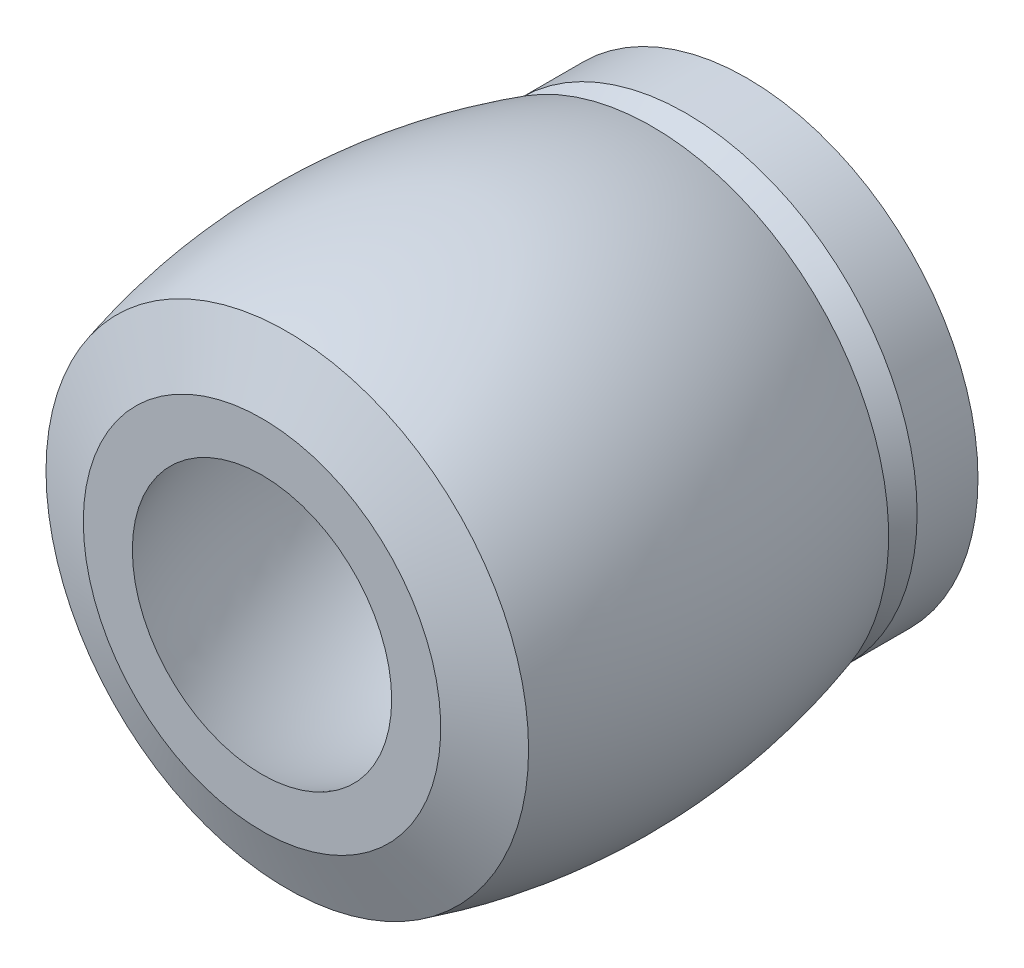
ISO-10303-21;
HEADER;
FILE_DESCRIPTION(('STEP AP214'),'2;1');
FILE_NAME('part.step','',(''),(''),'','','');
FILE_SCHEMA(('AUTOMOTIVE_DESIGN { 1 0 10303 214 1 1 1 1 }'));
ENDSEC;
DATA;
#1=APPLICATION_CONTEXT('core data for automotive mechanical design processes');
#2=APPLICATION_PROTOCOL_DEFINITION('international standard','automotive_design',2000,#1);
#3=PRODUCT_CONTEXT('',#1,'mechanical');
#4=PRODUCT('Part','Part','',(#3));
#5=PRODUCT_RELATED_PRODUCT_CATEGORY('part','',(#4));
#6=PRODUCT_DEFINITION_FORMATION('','',#4);
#7=PRODUCT_DEFINITION_CONTEXT('part definition',#1,'design');
#8=PRODUCT_DEFINITION('design','',#6,#7);
#9=PRODUCT_DEFINITION_SHAPE('','',#8);
#10=(LENGTH_UNIT() NAMED_UNIT(*) SI_UNIT(.MILLI.,.METRE.));
#11=(NAMED_UNIT(*) PLANE_ANGLE_UNIT() SI_UNIT($,.RADIAN.));
#12=(NAMED_UNIT(*) SI_UNIT($,.STERADIAN.) SOLID_ANGLE_UNIT());
#13=UNCERTAINTY_MEASURE_WITH_UNIT(LENGTH_MEASURE(1.E-05),#10,'distance_accuracy_value','');
#14=(GEOMETRIC_REPRESENTATION_CONTEXT(3) GLOBAL_UNCERTAINTY_ASSIGNED_CONTEXT((#13)) GLOBAL_UNIT_ASSIGNED_CONTEXT((#10,
#11,#12)) REPRESENTATION_CONTEXT('',''));
#15=CARTESIAN_POINT('',(0.,0.,0.));
#16=DIRECTION('',(0.,0.,1.));
#17=DIRECTION('',(1.,0.,0.));
#18=AXIS2_PLACEMENT_3D('',#15,#16,#17);
#19=CARTESIAN_POINT('',(0.,0.,0.));
#20=DIRECTION('',(0.,0.,-1.));
#21=DIRECTION('',(-1.,0.,0.));
#22=AXIS2_PLACEMENT_3D('',#19,#20,#21);
#23=CYLINDRICAL_SURFACE('',#22,1.778);
#24=CARTESIAN_POINT('',(0.,0.,0.));
#25=DIRECTION('',(0.,0.,-1.));
#26=DIRECTION('',(-1.,0.,0.));
#27=AXIS2_PLACEMENT_3D('',#24,#25,#26);
#28=CIRCLE('',#27,1.778);
#29=CARTESIAN_POINT('',(-1.778,0.,0.));
#30=VERTEX_POINT('',#29);
#31=EDGE_CURVE('E15',#30,#30,#28,.F.);
#32=ORIENTED_EDGE('',*,*,#31,.F.);
#33=EDGE_LOOP('',(#32));
#34=FACE_BOUND('',#33,.T.);
#35=CARTESIAN_POINT('',(0.,0.,2.14059832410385));
#36=DIRECTION('',(0.,0.,1.));
#37=DIRECTION('',(1.,0.,0.));
#38=AXIS2_PLACEMENT_3D('',#35,#36,#37);
#39=CIRCLE('',#38,1.77799999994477);
#40=CARTESIAN_POINT('',(1.77799999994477,0.,2.14059832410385));
#41=VERTEX_POINT('',#40);
#42=EDGE_CURVE('E99',#41,#41,#39,.T.);
#43=ORIENTED_EDGE('',*,*,#42,.T.);
#44=EDGE_LOOP('',(#43));
#45=FACE_BOUND('',#44,.T.);
#46=ADVANCED_FACE('F12',(#34,#45),#23,.F.);
#47=CARTESIAN_POINT('',(0.,0.,2.79399999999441));
#48=DIRECTION('',(0.,0.,1.));
#49=DIRECTION('',(1.,0.,0.));
#50=AXIS2_PLACEMENT_3D('',#47,#48,#49);
#51=CONICAL_SURFACE('',#50,3.11149999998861,1.11518873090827);
#52=CARTESIAN_POINT('',(0.,0.,2.794));
#53=DIRECTION('',(0.,0.,-1.));
#54=DIRECTION('',(-1.,0.,0.));
#55=AXIS2_PLACEMENT_3D('',#52,#53,#54);
#56=CIRCLE('',#55,3.1115);
#57=CARTESIAN_POINT('',(-3.1115,0.,2.794));
#58=VERTEX_POINT('',#57);
#59=EDGE_CURVE('E96',#58,#58,#56,.F.);
#60=ORIENTED_EDGE('',*,*,#59,.T.);
#61=EDGE_LOOP('',(#60));
#62=FACE_BOUND('',#61,.T.);
#63=ORIENTED_EDGE('',*,*,#42,.F.);
#64=EDGE_LOOP('',(#63));
#65=FACE_BOUND('',#64,.T.);
#66=ADVANCED_FACE('F46',(#62,#65),#51,.F.);
#67=CARTESIAN_POINT('',(-5.207,0.,0.));
#68=DIRECTION('',(0.,0.,-1.));
#69=DIRECTION('',(-1.,0.,0.));
#70=AXIS2_PLACEMENT_3D('',#67,#68,#69);
#71=PLANE('',#70);
#72=ORIENTED_EDGE('',*,*,#31,.T.);
#73=EDGE_LOOP('',(#72));
#74=FACE_BOUND('',#73,.T.);
#75=CARTESIAN_POINT('',(0.,0.,0.));
#76=DIRECTION('',(0.,0.,-1.));
#77=DIRECTION('',(-1.,0.,0.));
#78=AXIS2_PLACEMENT_3D('',#75,#76,#77);
#79=CIRCLE('',#78,5.207);
#80=CARTESIAN_POINT('',(-5.207,0.,0.));
#81=VERTEX_POINT('',#80);
#82=EDGE_CURVE('E92',#81,#81,#79,.F.);
#83=ORIENTED_EDGE('',*,*,#82,.F.);
#84=EDGE_LOOP('',(#83));
#85=FACE_BOUND('',#84,.T.);
#86=ADVANCED_FACE('F42',(#74,#85),#71,.T.);
#87=CARTESIAN_POINT('',(7.96581251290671,0.,6.60060790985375));
#88=DIRECTION('',(0.,1.,0.));
#89=DIRECTION('',(-1.,0.,0.));
#90=AXIS2_PLACEMENT_3D('',#87,#88,#89);
#91=CIRCLE('',#90,11.7131172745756);
#92=TRIMMED_CURVE('',#91,(PARAMETER_VALUE(-0.822929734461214)),
(PARAMETER_VALUE(0.822929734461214)),.T.,.PARAMETER.);
#93=CARTESIAN_POINT('',(0.,0.,6.60060790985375));
#94=DIRECTION('',(0.,0.,-1.));
#95=AXIS1_PLACEMENT('',#93,#94);
#96=SURFACE_OF_REVOLUTION('',#92,#95);
#97=ORIENTED_EDGE('',*,*,#59,.F.);
#98=EDGE_LOOP('',(#97));
#99=FACE_BOUND('',#98,.T.);
#100=CARTESIAN_POINT('',(0.,0.,10.922));
#101=DIRECTION('',(0.,0.,-1.));
#102=DIRECTION('',(-1.,0.,0.));
#103=AXIS2_PLACEMENT_3D('',#100,#101,#102);
#104=CIRCLE('',#103,2.921);
#105=CARTESIAN_POINT('',(-2.921,0.,10.922));
#106=VERTEX_POINT('',#105);
#107=EDGE_CURVE('E90',#106,#106,#104,.T.);
#108=ORIENTED_EDGE('',*,*,#107,.F.);
#109=EDGE_LOOP('',(#108));
#110=FACE_BOUND('',#109,.T.);
#111=ADVANCED_FACE('F37',(#99,#110),#96,.T.);
#112=CARTESIAN_POINT('',(0.,0.,0.));
#113=DIRECTION('',(0.,0.,-1.));
#114=DIRECTION('',(-1.,0.,0.));
#115=AXIS2_PLACEMENT_3D('',#112,#113,#114);
#116=CYLINDRICAL_SURFACE('',#115,5.207);
#117=ORIENTED_EDGE('',*,*,#82,.T.);
#118=EDGE_LOOP('',(#117));
#119=FACE_BOUND('',#118,.T.);
#120=CARTESIAN_POINT('',(0.,0.,1.37159999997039));
#121=DIRECTION('',(0.,0.,-1.));
#122=DIRECTION('',(-1.,0.,0.));
#123=AXIS2_PLACEMENT_3D('',#120,#121,#122);
#124=CIRCLE('',#123,5.20700000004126);
#125=CARTESIAN_POINT('',(-5.20700000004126,0.,1.37159999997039));
#126=VERTEX_POINT('',#125);
#127=EDGE_CURVE('E34',#126,#126,#124,.F.);
#128=ORIENTED_EDGE('',*,*,#127,.F.);
#129=EDGE_LOOP('',(#128));
#130=FACE_BOUND('',#129,.T.);
#131=ADVANCED_FACE('F41',(#119,#130),#116,.T.);
#132=CARTESIAN_POINT('',(-2.921,0.,10.922));
#133=DIRECTION('',(0.,0.,1.));
#134=DIRECTION('',(1.,0.,0.));
#135=AXIS2_PLACEMENT_3D('',#132,#133,#134);
#136=PLANE('',#135);
#137=CARTESIAN_POINT('',(0.,0.,10.9220000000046));
#138=DIRECTION('',(0.,0.,-1.));
#139=DIRECTION('',(-1.,0.,0.));
#140=AXIS2_PLACEMENT_3D('',#137,#138,#139);
#141=CIRCLE('',#140,4.02590000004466);
#142=CARTESIAN_POINT('',(-4.02590000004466,0.,10.9220000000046));
#143=VERTEX_POINT('',#142);
#144=EDGE_CURVE('E31',#143,#143,#141,.T.);
#145=ORIENTED_EDGE('',*,*,#144,.F.);
#146=EDGE_LOOP('',(#145));
#147=FACE_BOUND('',#146,.T.);
#148=ORIENTED_EDGE('',*,*,#107,.T.);
#149=EDGE_LOOP('',(#148));
#150=FACE_BOUND('',#149,.T.);
#151=ADVANCED_FACE('F76',(#147,#150),#136,.T.);
#152=CARTESIAN_POINT('',(0.,0.,1.37159999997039));
#153=DIRECTION('',(0.,0.,-1.));
#154=DIRECTION('',(-1.,0.,0.));
#155=AXIS2_PLACEMENT_3D('',#152,#153,#154);
#156=CONICAL_SURFACE('',#155,5.20700000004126,0.565835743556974);
#157=ORIENTED_EDGE('',*,*,#127,.T.);
#158=EDGE_LOOP('',(#157));
#159=FACE_BOUND('',#158,.T.);
#160=CARTESIAN_POINT('',(0.,0.,1.95834000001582));
#161=DIRECTION('',(0.,0.,1.));
#162=DIRECTION('',(1.,0.,0.));
#163=AXIS2_PLACEMENT_3D('',#160,#161,#162);
#164=CIRCLE('',#163,4.83435611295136);
#165=CARTESIAN_POINT('',(4.83435611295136,0.,1.95834000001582));
#166=VERTEX_POINT('',#165);
#167=EDGE_CURVE('E24',#166,#166,#164,.T.);
#168=ORIENTED_EDGE('',*,*,#167,.F.);
#169=EDGE_LOOP('',(#168));
#170=FACE_BOUND('',#169,.T.);
#171=ADVANCED_FACE('F73',(#159,#170),#156,.T.);
#172=CARTESIAN_POINT('',(0.,0.,10.3524442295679));
#173=DIRECTION('',(0.,0.,-1.));
#174=DIRECTION('',(-1.,0.,0.));
#175=AXIS2_PLACEMENT_3D('',#172,#173,#174);
#176=CONICAL_SURFACE('',#175,5.43559999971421,1.18682389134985);
#177=CARTESIAN_POINT('',(0.,0.,10.3524442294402));
#178=DIRECTION('',(0.,0.,-1.));
#179=DIRECTION('',(-1.,0.,0.));
#180=AXIS2_PLACEMENT_3D('',#177,#178,#179);
#181=CIRCLE('',#180,5.4356);
#182=CARTESIAN_POINT('',(-5.4356,0.,10.3524442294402));
#183=VERTEX_POINT('',#182);
#184=EDGE_CURVE('E19',#183,#183,#181,.T.);
#185=ORIENTED_EDGE('',*,*,#184,.F.);
#186=EDGE_LOOP('',(#185));
#187=FACE_BOUND('',#186,.T.);
#188=ORIENTED_EDGE('',*,*,#144,.T.);
#189=EDGE_LOOP('',(#188));
#190=FACE_BOUND('',#189,.T.);
#191=ADVANCED_FACE('F66',(#187,#190),#176,.T.);
#192=CARTESIAN_POINT('',(0.,0.,2.13283800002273));
#193=DIRECTION('',(0.,0.,1.));
#194=DIRECTION('',(1.,0.,0.));
#195=AXIS2_PLACEMENT_3D('',#192,#193,#194);
#196=CONICAL_SURFACE('',#195,5.32712326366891,1.23045712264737);
#197=CARTESIAN_POINT('',(0.,0.,2.132838));
#198=DIRECTION('',(0.,0.,-1.));
#199=DIRECTION('',(-1.,0.,0.));
#200=AXIS2_PLACEMENT_3D('',#197,#198,#199);
#201=CIRCLE('',#200,5.32712326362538);
#202=CARTESIAN_POINT('',(-5.32712326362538,0.,2.132838));
#203=VERTEX_POINT('',#202);
#204=EDGE_CURVE('E8',#203,#203,#201,.F.);
#205=ORIENTED_EDGE('',*,*,#204,.F.);
#206=EDGE_LOOP('',(#205));
#207=FACE_BOUND('',#206,.T.);
#208=ORIENTED_EDGE('',*,*,#167,.T.);
#209=EDGE_LOOP('',(#208));
#210=FACE_BOUND('',#209,.T.);
#211=ADVANCED_FACE('F60',(#207,#210),#196,.T.);
#212=CARTESIAN_POINT('',(8.69631239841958,0.,6.42842861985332));
#213=DIRECTION('',(0.,1.,0.));
#214=DIRECTION('',(-1.,0.,0.));
#215=AXIS2_PLACEMENT_3D('',#212,#213,#214);
#216=CIRCLE('',#215,14.6665894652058);
#217=TRIMMED_CURVE('',#216,(PARAMETER_VALUE(-0.936099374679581)),
(PARAMETER_VALUE(0.936099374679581)),.T.,.PARAMETER.);
#218=CARTESIAN_POINT('',(0.,0.,6.42842861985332));
#219=DIRECTION('',(0.,0.,-1.));
#220=AXIS1_PLACEMENT('',#218,#219);
#221=SURFACE_OF_REVOLUTION('',#217,#220);
#222=ORIENTED_EDGE('',*,*,#204,.T.);
#223=EDGE_LOOP('',(#222));
#224=FACE_BOUND('',#223,.T.);
#225=ORIENTED_EDGE('',*,*,#184,.T.);
#226=EDGE_LOOP('',(#225));
#227=FACE_BOUND('',#226,.T.);
#228=ADVANCED_FACE('F58',(#224,#227),#221,.F.);
#229=CLOSED_SHELL('',(#46,#66,#86,#111,#131,#151,#171,#191,#211,#228));
#230=MANIFOLD_SOLID_BREP('B1',#229);
#231=ADVANCED_BREP_SHAPE_REPRESENTATION('',(#18,#230),#14);
#232=SHAPE_DEFINITION_REPRESENTATION(#9,#231);
ENDSEC;
END-ISO-10303-21;
